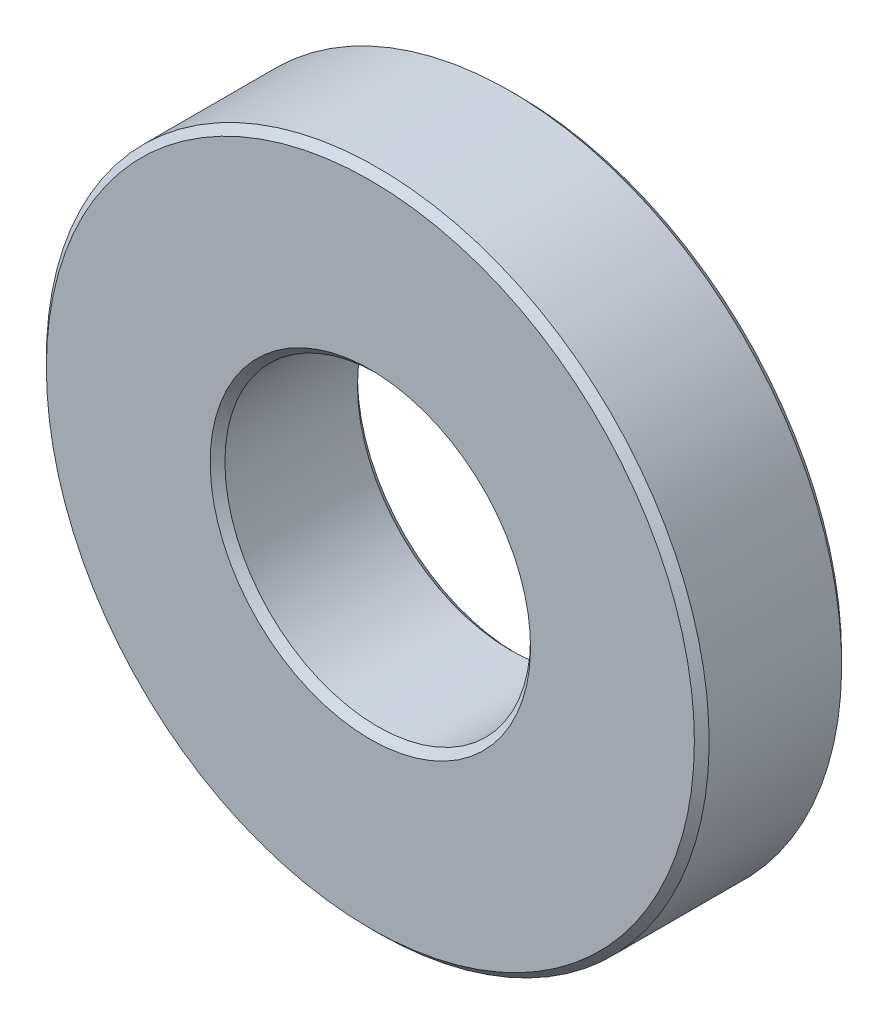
from build123d import *


with BuildPart() as part:
    # Sketch1 → Revolve1 (revolve)
    with BuildSketch(Plane(origin=(0, 0, 0), x_dir=(0, 0, -1), z_dir=(1, 0, 0)), mode=Mode.PRIVATE) as revolve1_sk:
        Polygon((-3.8, 4.15), (-0.2, 4.15), (0, 4.35), (0, 8.8), (-0.2, 9), (-3.8, 9), (-4, 8.8), (-4, 4.35), align=None)
    revolve(revolve1_sk.sketch.rotate(Axis((0, 0, 4), (0, 0, -1)), 180), axis=Axis((0, 0, 4), (0, 0, -1)))


solid = part.part
